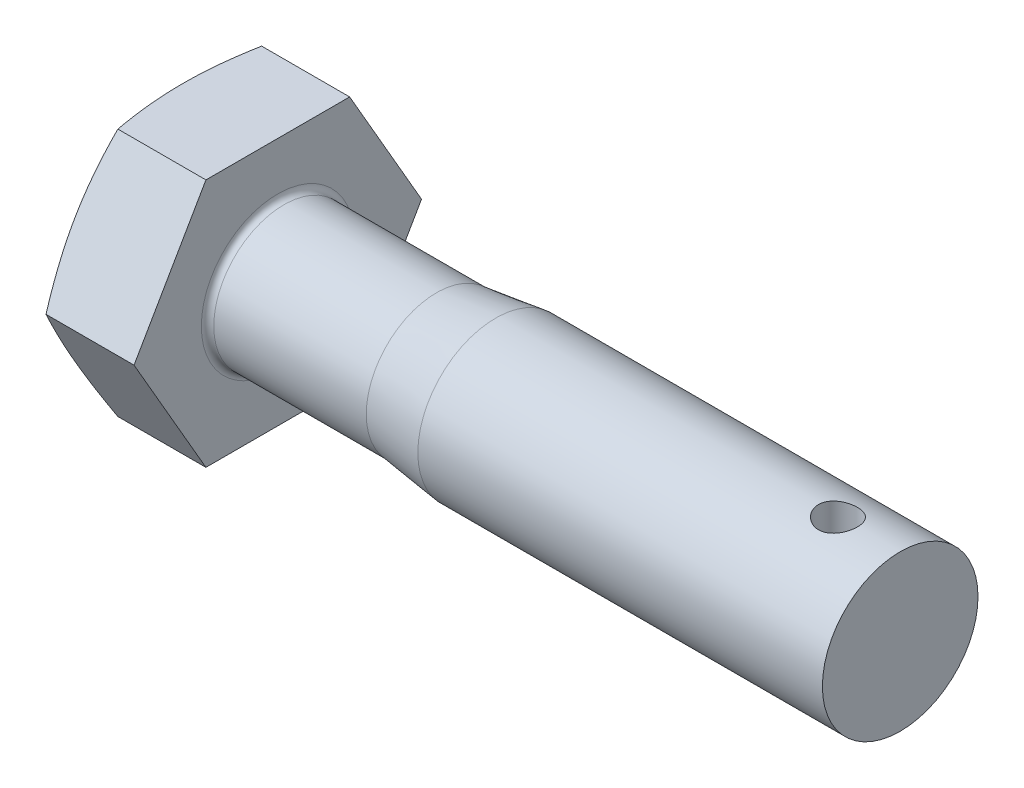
ISO-10303-21;
HEADER;
FILE_DESCRIPTION(('STEP AP214'),'2;1');
FILE_NAME('part.step','',(''),(''),'','','');
FILE_SCHEMA(('AUTOMOTIVE_DESIGN { 1 0 10303 214 1 1 1 1 }'));
ENDSEC;
DATA;
#1=APPLICATION_CONTEXT('core data for automotive mechanical design processes');
#2=APPLICATION_PROTOCOL_DEFINITION('international standard','automotive_design',2000,#1);
#3=PRODUCT_CONTEXT('',#1,'mechanical');
#4=PRODUCT('Part','Part','',(#3));
#5=PRODUCT_RELATED_PRODUCT_CATEGORY('part','',(#4));
#6=PRODUCT_DEFINITION_FORMATION('','',#4);
#7=PRODUCT_DEFINITION_CONTEXT('part definition',#1,'design');
#8=PRODUCT_DEFINITION('design','',#6,#7);
#9=PRODUCT_DEFINITION_SHAPE('','',#8);
#10=(LENGTH_UNIT() NAMED_UNIT(*) SI_UNIT(.MILLI.,.METRE.));
#11=(NAMED_UNIT(*) PLANE_ANGLE_UNIT() SI_UNIT($,.RADIAN.));
#12=(NAMED_UNIT(*) SI_UNIT($,.STERADIAN.) SOLID_ANGLE_UNIT());
#13=UNCERTAINTY_MEASURE_WITH_UNIT(LENGTH_MEASURE(1.E-05),#10,'distance_accuracy_value','');
#14=(GEOMETRIC_REPRESENTATION_CONTEXT(3) GLOBAL_UNCERTAINTY_ASSIGNED_CONTEXT((#13)) GLOBAL_UNIT_ASSIGNED_CONTEXT((#10,
#11,#12)) REPRESENTATION_CONTEXT('',''));
#15=CARTESIAN_POINT('',(0.,0.,0.));
#16=DIRECTION('',(0.,0.,1.));
#17=DIRECTION('',(1.,0.,0.));
#18=AXIS2_PLACEMENT_3D('',#15,#16,#17);
#19=CARTESIAN_POINT('',(0.,-8.,4.618802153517));
#20=DIRECTION('',(-1.,0.,0.));
#21=DIRECTION('',(0.,0.,1.));
#22=AXIS2_PLACEMENT_3D('',#19,#20,#21);
#23=PLANE('',#22);
#24=CARTESIAN_POINT('',(0.,0.,0.));
#25=DIRECTION('',(-1.,0.,0.));
#26=DIRECTION('',(0.,0.,1.));
#27=AXIS2_PLACEMENT_3D('',#24,#25,#26);
#28=CIRCLE('',#27,7.2);
#29=CARTESIAN_POINT('',(0.,0.,7.2));
#30=VERTEX_POINT('',#29);
#31=EDGE_CURVE('E97',#30,#30,#28,.T.);
#32=ORIENTED_EDGE('',*,*,#31,.T.);
#33=EDGE_LOOP('',(#32));
#34=FACE_BOUND('',#33,.T.);
#35=CARTESIAN_POINT('',(0.,0.,0.));
#36=DIRECTION('',(1.,0.,0.));
#37=DIRECTION('',(0.,0.,-1.));
#38=AXIS2_PLACEMENT_3D('',#35,#36,#37);
#39=CIRCLE('',#38,5.6);
#40=CARTESIAN_POINT('',(0.,0.,-5.6));
#41=VERTEX_POINT('',#40);
#42=EDGE_CURVE('E230',#41,#41,#39,.T.);
#43=ORIENTED_EDGE('',*,*,#42,.T.);
#44=EDGE_LOOP('',(#43));
#45=FACE_BOUND('',#44,.T.);
#46=ADVANCED_FACE('F32',(#34,#45),#23,.T.);
#47=CARTESIAN_POINT('',(6.4,-8.,4.618802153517));
#48=DIRECTION('',(0.,1.,0.));
#49=DIRECTION('',(0.,0.,1.));
#50=AXIS2_PLACEMENT_3D('',#47,#48,#49);
#51=PLANE('',#50);
#52=CARTESIAN_POINT('',(2.68976892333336,-8.,-12.2012465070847));
#53=CARTESIAN_POINT('',(2.57971664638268,-8.,-11.8395797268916));
#54=CARTESIAN_POINT('',(2.47095469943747,-8.,-11.4775129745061));
#55=CARTESIAN_POINT('',(2.25672537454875,-8.,-10.7523759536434));
#56=CARTESIAN_POINT('',(2.15125825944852,-8.,-10.3893056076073));
#57=CARTESIAN_POINT('',(1.94415537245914,-8.,-9.66133032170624));
#58=CARTESIAN_POINT('',(1.84252719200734,-8.,-9.29642321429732));
#59=CARTESIAN_POINT('',(1.64429920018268,-8.,-8.56524765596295));
#60=CARTESIAN_POINT('',(1.54769929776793,-8.,-8.19897922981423));
#61=CARTESIAN_POINT('',(1.36193890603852,-8.,-7.46941725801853));
#62=CARTESIAN_POINT('',(1.27270063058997,-8.,-7.10614361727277));
#63=CARTESIAN_POINT('',(1.10186352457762,-8.,-6.37778553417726));
#64=CARTESIAN_POINT('',(1.02026482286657,-8.,-6.01270106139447));
#65=CARTESIAN_POINT('',(0.866618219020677,-8.,-5.2806446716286));
#66=CARTESIAN_POINT('',(0.794566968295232,-8.,-4.91367346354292));
#67=CARTESIAN_POINT('',(0.662216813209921,-8.,-4.17760203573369));
#68=CARTESIAN_POINT('',(0.60191751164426,-8.,-3.80850188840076));
#69=CARTESIAN_POINT('',(0.501500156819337,-8.,-3.10978401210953));
#70=CARTESIAN_POINT('',(0.459876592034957,-8.,-2.78038468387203));
#71=CARTESIAN_POINT('',(0.389510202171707,-8.,-2.12020164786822));
#72=CARTESIAN_POINT('',(0.360767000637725,-8.,-1.78941798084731));
#73=CARTESIAN_POINT('',(0.317545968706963,-8.,-1.12713777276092));
#74=CARTESIAN_POINT('',(0.303058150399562,-8.,-0.795641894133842));
#75=CARTESIAN_POINT('',(0.289080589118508,-8.,-0.132330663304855));
#76=CARTESIAN_POINT('',(0.289590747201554,-8.,0.199484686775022));
#77=CARTESIAN_POINT('',(0.305622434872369,-8.,0.864453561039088));
#78=CARTESIAN_POINT('',(0.3212211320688,-8.,1.19760519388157));
#79=CARTESIAN_POINT('',(0.366713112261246,-8.,1.86292258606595));
#80=CARTESIAN_POINT('',(0.396606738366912,-8.,2.19508832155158));
#81=CARTESIAN_POINT('',(0.469296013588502,-8.,2.8582730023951));
#82=CARTESIAN_POINT('',(0.512102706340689,-8.,3.18929071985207));
#83=CARTESIAN_POINT('',(0.608889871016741,-8.,3.84966990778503));
#84=CARTESIAN_POINT('',(0.662870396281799,-8.,4.17903137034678));
#85=CARTESIAN_POINT('',(0.783783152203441,-8.,4.85578954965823));
#86=CARTESIAN_POINT('',(0.851298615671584,-8.,5.20308114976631));
#87=CARTESIAN_POINT('',(0.99502008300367,-8.,5.8958729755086));
#88=CARTESIAN_POINT('',(1.07122675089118,-8.,6.24137306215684));
#89=CARTESIAN_POINT('',(1.23072133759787,-8.,6.93083211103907));
#90=CARTESIAN_POINT('',(1.31401133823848,-8.,7.27479058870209));
#91=CARTESIAN_POINT('',(1.48631199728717,-8.,7.96125577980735));
#92=CARTESIAN_POINT('',(1.57532251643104,-8.,8.30376252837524));
#93=CARTESIAN_POINT('',(1.75810796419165,-8.,8.98797246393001));
#94=CARTESIAN_POINT('',(1.85188890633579,-8.,9.32967403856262));
#95=CARTESIAN_POINT('',(2.04325051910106,-8.,10.0120101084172));
#96=CARTESIAN_POINT('',(2.14083120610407,-8.,10.3526445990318));
#97=CARTESIAN_POINT('',(2.33909251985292,-8.,11.0329439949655));
#98=CARTESIAN_POINT('',(2.43977260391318,-8.,11.3726090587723));
#99=CARTESIAN_POINT('',(2.64371294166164,-8.,12.0511645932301));
#100=CARTESIAN_POINT('',(2.7469732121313,-8.,12.3900550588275));
#101=CARTESIAN_POINT('',(3.05757662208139,-8.,13.3980187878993));
#102=CARTESIAN_POINT('',(3.2680247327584,-8.,14.0661350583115));
#103=CARTESIAN_POINT('',(3.69484331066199,-8.,15.4004993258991));
#104=CARTESIAN_POINT('',(3.91121406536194,-8.,16.0667472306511));
#105=CARTESIAN_POINT('',(4.34746385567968,-8.,17.3952834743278));
#106=CARTESIAN_POINT('',(4.56732640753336,-8.,18.0575772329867));
#107=CARTESIAN_POINT('',(4.89953990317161,-8.,19.0501761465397));
#108=CARTESIAN_POINT('',(5.01067647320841,-8.,19.3808888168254));
#109=CARTESIAN_POINT('',(5.23366301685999,-8.,20.0420727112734));
#110=CARTESIAN_POINT('',(5.34551298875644,-8.,20.372543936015));
#111=CARTESIAN_POINT('',(5.45767192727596,-8.,20.7029103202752));
#112=B_SPLINE_CURVE_WITH_KNOTS('',3,(#52,#53,#54,#55,#56,#57,#58,#59,#60,#61,#62,#63,#64,#65,
#66,#67,#68,#69,#70,#71,#72,#73,#74,#75,#76,#77,#78,#79,#80,#81,#82,#83,#84,#85,#86,#87,#88,#89,
#90,#91,#92,#93,#94,#95,#96,#97,#98,#99,#100,#101,#102,#103,#104,#105,#106,#107,#108,#109,#110,
#111),.UNSPECIFIED.,.F.,.F.,(4,2,2,2,2,2,2,2,2,2,2,2,2,2,2,2,2,2,2,2,2,2,2,2,2,2,2,2,2,4),(0.,
1.13412858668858,2.26834741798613,3.40470280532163,4.54103761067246,5.66319372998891,
6.78536877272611,7.90714918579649,9.02889167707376,10.0247284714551,11.0205361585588,
12.015645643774,13.0107485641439,14.0109678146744,15.011211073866,16.0123122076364,
17.0134181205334,18.0746616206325,19.1359862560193,20.1976239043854,21.2592357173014,
22.3222206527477,23.3852101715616,24.4480146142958,25.5108259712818,27.6122114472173,
29.7136991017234,31.8071897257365,32.8538504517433,33.9005086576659),.UNSPECIFIED.);
#113=CARTESIAN_POINT('',(0.741627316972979,-8.00000000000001,-4.618802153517));
#114=VERTEX_POINT('',#113);
#115=CARTESIAN_POINT('',(0.741627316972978,-8.,4.618802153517));
#116=VERTEX_POINT('',#115);
#117=EDGE_CURVE('E54',#114,#116,#112,.T.);
#118=ORIENTED_EDGE('',*,*,#117,.F.);
#119=DIRECTION('',(-1.,0.,0.));
#120=VECTOR('',#119,1.);
#121=CARTESIAN_POINT('',(6.4,-8.,-4.61880215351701));
#122=LINE('',#121,#120);
#123=CARTESIAN_POINT('',(6.4,-8.,-4.61880215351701));
#124=VERTEX_POINT('',#123);
#125=EDGE_CURVE('E122',#124,#114,#122,.T.);
#126=ORIENTED_EDGE('',*,*,#125,.F.);
#127=DIRECTION('',(0.,0.,-1.));
#128=VECTOR('',#127,1.);
#129=CARTESIAN_POINT('',(6.4,-8.,4.618802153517));
#130=LINE('',#129,#128);
#131=CARTESIAN_POINT('',(6.4,-8.,4.618802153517));
#132=VERTEX_POINT('',#131);
#133=EDGE_CURVE('E259',#132,#124,#130,.T.);
#134=ORIENTED_EDGE('',*,*,#133,.F.);
#135=DIRECTION('',(-1.,0.,0.));
#136=VECTOR('',#135,1.);
#137=CARTESIAN_POINT('',(6.4,-8.,4.618802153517));
#138=LINE('',#137,#136);
#139=EDGE_CURVE('E110',#132,#116,#138,.T.);
#140=ORIENTED_EDGE('',*,*,#139,.T.);
#141=EDGE_LOOP('',(#118,#126,#134,#140));
#142=FACE_BOUND('',#141,.T.);
#143=ADVANCED_FACE('F34',(#142),#51,.F.);
#144=CARTESIAN_POINT('',(6.4,-8.,-4.61880215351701));
#145=DIRECTION('',(0.,0.5,0.866025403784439));
#146=DIRECTION('',(0.,-0.866025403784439,0.5));
#147=AXIS2_PLACEMENT_3D('',#144,#145,#146);
#148=PLANE('',#147);
#149=CARTESIAN_POINT('',(0.741669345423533,0.000200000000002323,-9.23771977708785));
#150=CARTESIAN_POINT('',(0.67202206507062,-0.331114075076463,-9.04643550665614));
#151=CARTESIAN_POINT('',(0.608665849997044,-0.663520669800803,-8.85452046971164));
#152=CARTESIAN_POINT('',(0.497200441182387,-1.33049516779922,-8.46944256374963));
#153=CARTESIAN_POINT('',(0.449103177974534,-1.66506455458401,-8.27627883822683));
#154=CARTESIAN_POINT('',(0.371307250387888,-2.33265174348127,-7.89084719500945));
#155=CARTESIAN_POINT('',(0.341438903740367,-2.66565429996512,-7.69858807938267));
#156=CARTESIAN_POINT('',(0.301377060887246,-3.33243813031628,-7.31362025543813));
#157=CARTESIAN_POINT('',(0.291176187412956,-3.66621906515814,-7.12091174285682));
#158=CARTESIAN_POINT('',(0.291176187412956,-4.33378093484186,-6.7354947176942));
#159=CARTESIAN_POINT('',(0.301377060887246,-4.66756186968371,-6.54278620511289));
#160=CARTESIAN_POINT('',(0.341438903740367,-5.33434570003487,-6.15781838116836));
#161=CARTESIAN_POINT('',(0.371307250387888,-5.66734825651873,-5.96555926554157));
#162=CARTESIAN_POINT('',(0.449103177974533,-6.33493544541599,-5.58012762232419));
#163=CARTESIAN_POINT('',(0.497200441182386,-6.66950483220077,-5.38696389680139));
#164=CARTESIAN_POINT('',(0.608665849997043,-7.33647933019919,-5.00188599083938));
#165=CARTESIAN_POINT('',(0.672022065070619,-7.66888592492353,-4.80997095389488));
#166=CARTESIAN_POINT('',(0.741669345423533,-8.0002,-4.61868668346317));
#167=B_SPLINE_CURVE_WITH_KNOTS('',3,(#149,#150,#151,#152,#153,#154,#155,#156,#157,#158,#159,
#160,#161,#162,#163,#164,#165,#166),.UNSPECIFIED.,.F.,.F.,(4,2,2,2,2,2,2,2,4),(0.,
1.16669003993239,2.33429004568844,3.4908488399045,4.6469737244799,5.80309860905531,
6.95965740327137,8.12725740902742,9.29394744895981),.UNSPECIFIED.);
#168=CARTESIAN_POINT('',(0.741627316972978,0.,-9.23760430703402));
#169=VERTEX_POINT('',#168);
#170=EDGE_CURVE('E192',#169,#114,#167,.T.);
#171=ORIENTED_EDGE('',*,*,#170,.F.);
#172=DIRECTION('',(-1.,0.,0.));
#173=VECTOR('',#172,1.);
#174=CARTESIAN_POINT('',(6.4,0.,-9.23760430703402));
#175=LINE('',#174,#173);
#176=CARTESIAN_POINT('',(6.4,0.,-9.23760430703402));
#177=VERTEX_POINT('',#176);
#178=EDGE_CURVE('E119',#177,#169,#175,.T.);
#179=ORIENTED_EDGE('',*,*,#178,.F.);
#180=DIRECTION('',(0.,0.866025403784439,-0.5));
#181=VECTOR('',#180,1.);
#182=CARTESIAN_POINT('',(6.4,-8.,-4.61880215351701));
#183=LINE('',#182,#181);
#184=EDGE_CURVE('E260',#124,#177,#183,.T.);
#185=ORIENTED_EDGE('',*,*,#184,.F.);
#186=ORIENTED_EDGE('',*,*,#125,.T.);
#187=EDGE_LOOP('',(#171,#179,#185,#186));
#188=FACE_BOUND('',#187,.T.);
#189=ADVANCED_FACE('F200',(#188),#148,.F.);
#190=CARTESIAN_POINT('',(6.4,0.,-9.23760430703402));
#191=DIRECTION('',(0.,-0.5,0.866025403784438));
#192=DIRECTION('',(0.,-0.866025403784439,-0.5));
#193=AXIS2_PLACEMENT_3D('',#190,#191,#192);
#194=PLANE('',#193);
#195=CARTESIAN_POINT('',(0.741669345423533,8.0002,-4.61868668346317));
#196=CARTESIAN_POINT('',(0.672022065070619,7.66888592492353,-4.80997095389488));
#197=CARTESIAN_POINT('',(0.608665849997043,7.33647933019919,-5.00188599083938));
#198=CARTESIAN_POINT('',(0.497200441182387,6.66950483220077,-5.38696389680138));
#199=CARTESIAN_POINT('',(0.449103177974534,6.33493544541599,-5.58012762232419));
#200=CARTESIAN_POINT('',(0.371307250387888,5.66734825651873,-5.96555926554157));
#201=CARTESIAN_POINT('',(0.341438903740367,5.33434570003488,-6.15781838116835));
#202=CARTESIAN_POINT('',(0.301377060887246,4.66756186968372,-6.54278620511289));
#203=CARTESIAN_POINT('',(0.291176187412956,4.33378093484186,-6.7354947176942));
#204=CARTESIAN_POINT('',(0.291176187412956,3.66621906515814,-7.12091174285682));
#205=CARTESIAN_POINT('',(0.301377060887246,3.33243813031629,-7.31362025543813));
#206=CARTESIAN_POINT('',(0.341438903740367,2.66565429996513,-7.69858807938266));
#207=CARTESIAN_POINT('',(0.371307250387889,2.33265174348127,-7.89084719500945));
#208=CARTESIAN_POINT('',(0.449103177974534,1.66506455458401,-8.27627883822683));
#209=CARTESIAN_POINT('',(0.497200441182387,1.33049516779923,-8.46944256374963));
#210=CARTESIAN_POINT('',(0.608665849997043,0.66352066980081,-8.85452046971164));
#211=CARTESIAN_POINT('',(0.672022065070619,0.331114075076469,-9.04643550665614));
#212=CARTESIAN_POINT('',(0.741669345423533,-0.000199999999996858,-9.23771977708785));
#213=B_SPLINE_CURVE_WITH_KNOTS('',3,(#195,#196,#197,#198,#199,#200,#201,#202,#203,#204,#205,
#206,#207,#208,#209,#210,#211,#212),.UNSPECIFIED.,.F.,.F.,(4,2,2,2,2,2,2,2,4),(0.,
1.16669003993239,2.33429004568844,3.4908488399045,4.6469737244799,5.80309860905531,
6.95965740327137,8.12725740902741,9.2939474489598),.UNSPECIFIED.);
#214=CARTESIAN_POINT('',(0.741627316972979,8.,-4.61880215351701));
#215=VERTEX_POINT('',#214);
#216=EDGE_CURVE('E186',#215,#169,#213,.T.);
#217=ORIENTED_EDGE('',*,*,#216,.F.);
#218=DIRECTION('',(-1.,0.,0.));
#219=VECTOR('',#218,1.);
#220=CARTESIAN_POINT('',(6.4,8.,-4.618802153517));
#221=LINE('',#220,#219);
#222=CARTESIAN_POINT('',(6.4,8.,-4.618802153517));
#223=VERTEX_POINT('',#222);
#224=EDGE_CURVE('E112',#223,#215,#221,.T.);
#225=ORIENTED_EDGE('',*,*,#224,.F.);
#226=DIRECTION('',(0.,0.866025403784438,0.5));
#227=VECTOR('',#226,1.);
#228=CARTESIAN_POINT('',(6.4,0.,-9.23760430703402));
#229=LINE('',#228,#227);
#230=EDGE_CURVE('E264',#177,#223,#229,.T.);
#231=ORIENTED_EDGE('',*,*,#230,.F.);
#232=ORIENTED_EDGE('',*,*,#178,.T.);
#233=EDGE_LOOP('',(#217,#225,#231,#232));
#234=FACE_BOUND('',#233,.T.);
#235=ADVANCED_FACE('F203',(#234),#194,.F.);
#236=CARTESIAN_POINT('',(6.4,8.,-4.618802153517));
#237=DIRECTION('',(0.,-1.,0.));
#238=DIRECTION('',(0.,0.,-1.));
#239=AXIS2_PLACEMENT_3D('',#236,#237,#238);
#240=PLANE('',#239);
#241=CARTESIAN_POINT('',(2.68976892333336,8.,-12.2012465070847));
#242=CARTESIAN_POINT('',(2.57971664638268,8.,-11.8395797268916));
#243=CARTESIAN_POINT('',(2.47095469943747,8.,-11.4775129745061));
#244=CARTESIAN_POINT('',(2.25672537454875,8.,-10.7523759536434));
#245=CARTESIAN_POINT('',(2.15125825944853,8.,-10.3893056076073));
#246=CARTESIAN_POINT('',(1.94415537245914,8.,-9.66133032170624));
#247=CARTESIAN_POINT('',(1.84252719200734,8.,-9.29642321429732));
#248=CARTESIAN_POINT('',(1.64429920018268,8.,-8.56524765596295));
#249=CARTESIAN_POINT('',(1.54769929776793,8.,-8.19897922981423));
#250=CARTESIAN_POINT('',(1.36193890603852,8.,-7.46941725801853));
#251=CARTESIAN_POINT('',(1.27270063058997,8.,-7.10614361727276));
#252=CARTESIAN_POINT('',(1.10186352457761,8.,-6.37778553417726));
#253=CARTESIAN_POINT('',(1.02026482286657,8.,-6.01270106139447));
#254=CARTESIAN_POINT('',(0.866618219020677,8.,-5.2806446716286));
#255=CARTESIAN_POINT('',(0.794566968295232,8.,-4.91367346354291));
#256=CARTESIAN_POINT('',(0.662216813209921,8.,-4.17760203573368));
#257=CARTESIAN_POINT('',(0.60191751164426,8.,-3.80850188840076));
#258=CARTESIAN_POINT('',(0.501500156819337,8.,-3.10978401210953));
#259=CARTESIAN_POINT('',(0.459876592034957,8.,-2.78038468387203));
#260=CARTESIAN_POINT('',(0.389510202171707,8.,-2.12020164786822));
#261=CARTESIAN_POINT('',(0.360767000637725,8.,-1.7894179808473));
#262=CARTESIAN_POINT('',(0.317545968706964,8.,-1.12713777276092));
#263=CARTESIAN_POINT('',(0.303058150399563,8.,-0.795641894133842));
#264=CARTESIAN_POINT('',(0.289080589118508,8.,-0.132330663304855));
#265=CARTESIAN_POINT('',(0.289590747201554,8.,0.199484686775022));
#266=CARTESIAN_POINT('',(0.305622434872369,8.,0.864453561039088));
#267=CARTESIAN_POINT('',(0.3212211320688,8.,1.19760519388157));
#268=CARTESIAN_POINT('',(0.366713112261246,8.,1.86292258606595));
#269=CARTESIAN_POINT('',(0.396606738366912,8.,2.19508832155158));
#270=CARTESIAN_POINT('',(0.469296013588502,8.,2.8582730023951));
#271=CARTESIAN_POINT('',(0.512102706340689,8.,3.18929071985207));
#272=CARTESIAN_POINT('',(0.608889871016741,8.,3.84966990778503));
#273=CARTESIAN_POINT('',(0.662870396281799,8.,4.17903137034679));
#274=CARTESIAN_POINT('',(0.783783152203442,8.,4.85578954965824));
#275=CARTESIAN_POINT('',(0.851298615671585,8.,5.20308114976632));
#276=CARTESIAN_POINT('',(0.995020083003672,8.,5.8958729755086));
#277=CARTESIAN_POINT('',(1.07122675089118,8.,6.24137306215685));
#278=CARTESIAN_POINT('',(1.23072133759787,8.,6.93083211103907));
#279=CARTESIAN_POINT('',(1.31401133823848,8.,7.2747905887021));
#280=CARTESIAN_POINT('',(1.48631199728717,8.,7.96125577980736));
#281=CARTESIAN_POINT('',(1.57532251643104,8.,8.30376252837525));
#282=CARTESIAN_POINT('',(1.75810796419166,8.,8.98797246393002));
#283=CARTESIAN_POINT('',(1.8518889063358,8.,9.32967403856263));
#284=CARTESIAN_POINT('',(2.04325051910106,8.,10.0120101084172));
#285=CARTESIAN_POINT('',(2.14083120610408,8.,10.3526445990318));
#286=CARTESIAN_POINT('',(2.33909251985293,8.,11.0329439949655));
#287=CARTESIAN_POINT('',(2.43977260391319,8.,11.3726090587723));
#288=CARTESIAN_POINT('',(2.64371294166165,8.,12.0511645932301));
#289=CARTESIAN_POINT('',(2.74697321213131,8.,12.3900550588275));
#290=CARTESIAN_POINT('',(3.0575766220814,8.,13.3980187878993));
#291=CARTESIAN_POINT('',(3.26802473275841,8.,14.0661350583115));
#292=CARTESIAN_POINT('',(3.694843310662,8.,15.4004993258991));
#293=CARTESIAN_POINT('',(3.91121406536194,8.,16.0667472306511));
#294=CARTESIAN_POINT('',(4.34746385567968,8.,17.3952834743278));
#295=CARTESIAN_POINT('',(4.56732640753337,8.,18.0575772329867));
#296=CARTESIAN_POINT('',(4.89953990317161,8.,19.0501761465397));
#297=CARTESIAN_POINT('',(5.01067647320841,8.,19.3808888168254));
#298=CARTESIAN_POINT('',(5.23366301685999,8.,20.0420727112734));
#299=CARTESIAN_POINT('',(5.34551298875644,8.,20.372543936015));
#300=CARTESIAN_POINT('',(5.45767192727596,8.,20.7029103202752));
#301=B_SPLINE_CURVE_WITH_KNOTS('',3,(#241,#242,#243,#244,#245,#246,#247,#248,#249,#250,#251,
#252,#253,#254,#255,#256,#257,#258,#259,#260,#261,#262,#263,#264,#265,#266,#267,#268,#269,#270,
#271,#272,#273,#274,#275,#276,#277,#278,#279,#280,#281,#282,#283,#284,#285,#286,#287,#288,#289,
#290,#291,#292,#293,#294,#295,#296,#297,#298,#299,#300),.UNSPECIFIED.,.F.,.F.,(4,2,2,2,2,2,2,2,
2,2,2,2,2,2,2,2,2,2,2,2,2,2,2,2,2,2,2,2,2,4),(0.,1.13412858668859,2.26834741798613,
3.40470280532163,4.54103761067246,5.66319372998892,6.78536877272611,7.9071491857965,
9.02889167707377,10.0247284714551,11.0205361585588,12.015645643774,13.0107485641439,
14.0109678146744,15.011211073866,16.0123122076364,17.0134181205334,18.0746616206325,
19.1359862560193,20.1976239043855,21.2592357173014,22.3222206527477,23.3852101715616,
24.4480146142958,25.5108259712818,27.6122114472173,29.7136991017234,31.8071897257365,
32.8538504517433,33.9005086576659),.UNSPECIFIED.);
#302=CARTESIAN_POINT('',(0.74162731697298,8.,4.61880215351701));
#303=VERTEX_POINT('',#302);
#304=EDGE_CURVE('E107',#303,#215,#301,.F.);
#305=ORIENTED_EDGE('',*,*,#304,.F.);
#306=DIRECTION('',(-1.,0.,0.));
#307=VECTOR('',#306,1.);
#308=CARTESIAN_POINT('',(6.4,8.,4.61880215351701));
#309=LINE('',#308,#307);
#310=CARTESIAN_POINT('',(6.4,8.,4.61880215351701));
#311=VERTEX_POINT('',#310);
#312=EDGE_CURVE('E106',#311,#303,#309,.T.);
#313=ORIENTED_EDGE('',*,*,#312,.F.);
#314=DIRECTION('',(0.,0.,1.));
#315=VECTOR('',#314,1.);
#316=CARTESIAN_POINT('',(6.4,8.,-4.618802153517));
#317=LINE('',#316,#315);
#318=EDGE_CURVE('E266',#223,#311,#317,.T.);
#319=ORIENTED_EDGE('',*,*,#318,.F.);
#320=ORIENTED_EDGE('',*,*,#224,.T.);
#321=EDGE_LOOP('',(#305,#313,#319,#320));
#322=FACE_BOUND('',#321,.T.);
#323=ADVANCED_FACE('F207',(#322),#240,.F.);
#324=CARTESIAN_POINT('',(6.4,8.,4.61880215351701));
#325=DIRECTION('',(0.,-0.5,-0.866025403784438));
#326=DIRECTION('',(0.,0.866025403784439,-0.5));
#327=AXIS2_PLACEMENT_3D('',#324,#325,#326);
#328=PLANE('',#327);
#329=CARTESIAN_POINT('',(0.741669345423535,-0.000199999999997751,9.23771977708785));
#330=CARTESIAN_POINT('',(0.672022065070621,0.331114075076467,9.04643550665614));
#331=CARTESIAN_POINT('',(0.608665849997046,0.663520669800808,8.85452046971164));
#332=CARTESIAN_POINT('',(0.497200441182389,1.33049516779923,8.46944256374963));
#333=CARTESIAN_POINT('',(0.449103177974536,1.66506455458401,8.27627883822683));
#334=CARTESIAN_POINT('',(0.371307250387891,2.33265174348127,7.89084719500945));
#335=CARTESIAN_POINT('',(0.341438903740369,2.66565429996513,7.69858807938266));
#336=CARTESIAN_POINT('',(0.301377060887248,3.33243813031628,7.31362025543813));
#337=CARTESIAN_POINT('',(0.291176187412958,3.66621906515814,7.12091174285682));
#338=CARTESIAN_POINT('',(0.291176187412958,4.33378093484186,6.7354947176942));
#339=CARTESIAN_POINT('',(0.301377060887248,4.66756186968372,6.54278620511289));
#340=CARTESIAN_POINT('',(0.341438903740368,5.33434570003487,6.15781838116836));
#341=CARTESIAN_POINT('',(0.37130725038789,5.66734825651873,5.96555926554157));
#342=CARTESIAN_POINT('',(0.449103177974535,6.33493544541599,5.58012762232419));
#343=CARTESIAN_POINT('',(0.497200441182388,6.66950483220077,5.38696389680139));
#344=CARTESIAN_POINT('',(0.608665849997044,7.33647933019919,5.00188599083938));
#345=CARTESIAN_POINT('',(0.67202206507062,7.66888592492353,4.80997095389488));
#346=CARTESIAN_POINT('',(0.741669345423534,8.0002,4.61868668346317));
#347=B_SPLINE_CURVE_WITH_KNOTS('',3,(#329,#330,#331,#332,#333,#334,#335,#336,#337,#338,#339,
#340,#341,#342,#343,#344,#345,#346),.UNSPECIFIED.,.F.,.F.,(4,2,2,2,2,2,2,2,4),(0.,
1.16669003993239,2.33429004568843,3.49084883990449,4.6469737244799,5.8030986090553,
6.95965740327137,8.12725740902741,9.2939474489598),.UNSPECIFIED.);
#348=CARTESIAN_POINT('',(0.74162731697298,0.,9.23760430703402));
#349=VERTEX_POINT('',#348);
#350=EDGE_CURVE('E92',#349,#303,#347,.T.);
#351=ORIENTED_EDGE('',*,*,#350,.F.);
#352=DIRECTION('',(-1.,0.,0.));
#353=VECTOR('',#352,1.);
#354=CARTESIAN_POINT('',(6.4,0.,9.23760430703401));
#355=LINE('',#354,#353);
#356=CARTESIAN_POINT('',(6.4,0.,9.23760430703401));
#357=VERTEX_POINT('',#356);
#358=EDGE_CURVE('E104',#357,#349,#355,.T.);
#359=ORIENTED_EDGE('',*,*,#358,.F.);
#360=DIRECTION('',(0.,-0.866025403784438,0.5));
#361=VECTOR('',#360,1.);
#362=CARTESIAN_POINT('',(6.4,8.,4.61880215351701));
#363=LINE('',#362,#361);
#364=EDGE_CURVE('E268',#311,#357,#363,.T.);
#365=ORIENTED_EDGE('',*,*,#364,.F.);
#366=ORIENTED_EDGE('',*,*,#312,.T.);
#367=EDGE_LOOP('',(#351,#359,#365,#366));
#368=FACE_BOUND('',#367,.T.);
#369=ADVANCED_FACE('F102',(#368),#328,.F.);
#370=CARTESIAN_POINT('',(6.4,0.,9.23760430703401));
#371=DIRECTION('',(0.,0.5,-0.866025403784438));
#372=DIRECTION('',(0.,0.866025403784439,0.5));
#373=AXIS2_PLACEMENT_3D('',#370,#371,#372);
#374=PLANE('',#373);
#375=CARTESIAN_POINT('',(0.741669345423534,-8.0002,4.61868668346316));
#376=CARTESIAN_POINT('',(0.672022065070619,-7.66888592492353,4.80997095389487));
#377=CARTESIAN_POINT('',(0.608665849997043,-7.33647933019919,5.00188599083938));
#378=CARTESIAN_POINT('',(0.497200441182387,-6.66950483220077,5.38696389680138));
#379=CARTESIAN_POINT('',(0.449103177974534,-6.33493544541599,5.58012762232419));
#380=CARTESIAN_POINT('',(0.371307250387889,-5.66734825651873,5.96555926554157));
#381=CARTESIAN_POINT('',(0.341438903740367,-5.33434570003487,6.15781838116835));
#382=CARTESIAN_POINT('',(0.301377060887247,-4.66756186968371,6.54278620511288));
#383=CARTESIAN_POINT('',(0.291176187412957,-4.33378093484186,6.7354947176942));
#384=CARTESIAN_POINT('',(0.291176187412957,-3.66621906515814,7.12091174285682));
#385=CARTESIAN_POINT('',(0.301377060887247,-3.33243813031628,7.31362025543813));
#386=CARTESIAN_POINT('',(0.341438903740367,-2.66565429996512,7.69858807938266));
#387=CARTESIAN_POINT('',(0.371307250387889,-2.33265174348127,7.89084719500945));
#388=CARTESIAN_POINT('',(0.449103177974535,-1.66506455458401,8.27627883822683));
#389=CARTESIAN_POINT('',(0.497200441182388,-1.33049516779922,8.46944256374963));
#390=CARTESIAN_POINT('',(0.608665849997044,-0.663520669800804,8.85452046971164));
#391=CARTESIAN_POINT('',(0.672022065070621,-0.331114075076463,9.04643550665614));
#392=CARTESIAN_POINT('',(0.741669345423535,0.00020000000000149,9.23771977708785));
#393=B_SPLINE_CURVE_WITH_KNOTS('',3,(#375,#376,#377,#378,#379,#380,#381,#382,#383,#384,#385,
#386,#387,#388,#389,#390,#391,#392),.UNSPECIFIED.,.F.,.F.,(4,2,2,2,2,2,2,2,4),(0.,
1.16669003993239,2.33429004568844,3.4908488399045,4.6469737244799,5.80309860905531,
6.95965740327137,8.12725740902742,9.29394744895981),.UNSPECIFIED.);
#394=EDGE_CURVE('E89',#116,#349,#393,.T.);
#395=ORIENTED_EDGE('',*,*,#394,.F.);
#396=ORIENTED_EDGE('',*,*,#139,.F.);
#397=DIRECTION('',(0.,-0.866025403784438,-0.5));
#398=VECTOR('',#397,1.);
#399=CARTESIAN_POINT('',(6.4,0.,9.23760430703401));
#400=LINE('',#399,#398);
#401=EDGE_CURVE('E62',#357,#132,#400,.T.);
#402=ORIENTED_EDGE('',*,*,#401,.F.);
#403=ORIENTED_EDGE('',*,*,#358,.T.);
#404=EDGE_LOOP('',(#395,#396,#402,#403));
#405=FACE_BOUND('',#404,.T.);
#406=ADVANCED_FACE('F109',(#405),#374,.F.);
#407=CARTESIAN_POINT('',(6.4,-8.,4.618802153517));
#408=DIRECTION('',(-1.,0.,0.));
#409=DIRECTION('',(0.,0.,1.));
#410=AXIS2_PLACEMENT_3D('',#407,#408,#409);
#411=PLANE('',#410);
#412=CARTESIAN_POINT('',(6.4,0.,0.));
#413=DIRECTION('',(-1.,0.,0.));
#414=DIRECTION('',(0.,0.,1.));
#415=AXIS2_PLACEMENT_3D('',#412,#413,#414);
#416=CIRCLE('',#415,4.913);
#417=CARTESIAN_POINT('',(6.4,0.,4.913));
#418=VERTEX_POINT('',#417);
#419=EDGE_CURVE('E46',#418,#418,#416,.T.);
#420=ORIENTED_EDGE('',*,*,#419,.T.);
#421=EDGE_LOOP('',(#420));
#422=FACE_BOUND('',#421,.T.);
#423=ORIENTED_EDGE('',*,*,#401,.T.);
#424=ORIENTED_EDGE('',*,*,#133,.T.);
#425=ORIENTED_EDGE('',*,*,#184,.T.);
#426=ORIENTED_EDGE('',*,*,#230,.T.);
#427=ORIENTED_EDGE('',*,*,#318,.T.);
#428=ORIENTED_EDGE('',*,*,#364,.T.);
#429=EDGE_LOOP('',(#423,#424,#425,#426,#427,#428));
#430=FACE_BOUND('',#429,.T.);
#431=ADVANCED_FACE('F163',(#422,#430),#411,.F.);
#432=CARTESIAN_POINT('',(0.,0.,0.));
#433=DIRECTION('',(1.,0.,0.));
#434=DIRECTION('',(0.,0.,-1.));
#435=AXIS2_PLACEMENT_3D('',#432,#433,#434);
#436=CONICAL_SURFACE('',#435,7.2,1.22173047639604);
#437=ORIENTED_EDGE('',*,*,#31,.F.);
#438=EDGE_LOOP('',(#437));
#439=FACE_BOUND('',#438,.T.);
#440=ORIENTED_EDGE('',*,*,#117,.T.);
#441=ORIENTED_EDGE('',*,*,#394,.T.);
#442=ORIENTED_EDGE('',*,*,#350,.T.);
#443=ORIENTED_EDGE('',*,*,#304,.T.);
#444=ORIENTED_EDGE('',*,*,#216,.T.);
#445=ORIENTED_EDGE('',*,*,#170,.T.);
#446=EDGE_LOOP('',(#440,#441,#442,#443,#444,#445));
#447=FACE_BOUND('',#446,.T.);
#448=ADVANCED_FACE('F91',(#439,#447),#436,.T.);
#449=CARTESIAN_POINT('',(1.28,0.,0.));
#450=DIRECTION('',(-1.,0.,0.));
#451=DIRECTION('',(0.,0.,1.));
#452=AXIS2_PLACEMENT_3D('',#449,#450,#451);
#453=CYLINDRICAL_SURFACE('',#452,5.6);
#454=CARTESIAN_POINT('',(1.28,0.,0.));
#455=DIRECTION('',(1.,0.,0.));
#456=DIRECTION('',(0.,0.,-1.));
#457=AXIS2_PLACEMENT_3D('',#454,#455,#456);
#458=CIRCLE('',#457,5.6);
#459=CARTESIAN_POINT('',(1.28,0.,-5.6));
#460=VERTEX_POINT('',#459);
#461=EDGE_CURVE('E232',#460,#460,#458,.T.);
#462=ORIENTED_EDGE('',*,*,#461,.T.);
#463=EDGE_LOOP('',(#462));
#464=FACE_BOUND('',#463,.T.);
#465=ORIENTED_EDGE('',*,*,#42,.F.);
#466=EDGE_LOOP('',(#465));
#467=FACE_BOUND('',#466,.T.);
#468=ADVANCED_FACE('F156',(#464,#467),#453,.F.);
#469=CARTESIAN_POINT('',(1.28,0.,0.));
#470=DIRECTION('',(1.,0.,0.));
#471=DIRECTION('',(0.,0.,-1.));
#472=AXIS2_PLACEMENT_3D('',#469,#470,#471);
#473=PLANE('',#472);
#474=ORIENTED_EDGE('',*,*,#461,.F.);
#475=EDGE_LOOP('',(#474));
#476=FACE_BOUND('',#475,.T.);
#477=ADVANCED_FACE('F152',(#476),#473,.F.);
#478=CARTESIAN_POINT('',(16.6,0.,0.));
#479=DIRECTION('',(1.,0.,0.));
#480=DIRECTION('',(0.,0.,-1.));
#481=AXIS2_PLACEMENT_3D('',#478,#479,#480);
#482=CONICAL_SURFACE('',#481,4.513,0.127463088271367);
#483=CARTESIAN_POINT('',(20.4,0.,0.));
#484=DIRECTION('',(-1.,0.,0.));
#485=DIRECTION('',(0.,0.,1.));
#486=AXIS2_PLACEMENT_3D('',#483,#484,#485);
#487=CIRCLE('',#486,5.);
#488=CARTESIAN_POINT('',(20.4,0.,4.99999999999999));
#489=VERTEX_POINT('',#488);
#490=EDGE_CURVE('E233',#489,#489,#487,.T.);
#491=ORIENTED_EDGE('',*,*,#490,.T.);
#492=EDGE_LOOP('',(#491));
#493=FACE_BOUND('',#492,.T.);
#494=CARTESIAN_POINT('',(16.6,0.,0.));
#495=DIRECTION('',(-1.,0.,0.));
#496=DIRECTION('',(0.,0.,1.));
#497=AXIS2_PLACEMENT_3D('',#494,#495,#496);
#498=CIRCLE('',#497,4.513);
#499=CARTESIAN_POINT('',(16.6,0.,4.513));
#500=VERTEX_POINT('',#499);
#501=EDGE_CURVE('E238',#500,#500,#498,.T.);
#502=ORIENTED_EDGE('',*,*,#501,.F.);
#503=EDGE_LOOP('',(#502));
#504=FACE_BOUND('',#503,.T.);
#505=ADVANCED_FACE('F148',(#493,#504),#482,.T.);
#506=CARTESIAN_POINT('',(0.,0.,0.));
#507=DIRECTION('',(-1.,0.,0.));
#508=DIRECTION('',(0.,0.,1.));
#509=AXIS2_PLACEMENT_3D('',#506,#507,#508);
#510=CYLINDRICAL_SURFACE('',#509,4.513);
#511=CARTESIAN_POINT('',(6.8,0.,0.));
#512=DIRECTION('',(-1.,0.,0.));
#513=DIRECTION('',(0.,0.,1.));
#514=AXIS2_PLACEMENT_3D('',#511,#512,#513);
#515=CIRCLE('',#514,4.513);
#516=CARTESIAN_POINT('',(6.8,0.,4.513));
#517=VERTEX_POINT('',#516);
#518=EDGE_CURVE('E11',#517,#517,#515,.F.);
#519=ORIENTED_EDGE('',*,*,#518,.T.);
#520=EDGE_LOOP('',(#519));
#521=FACE_BOUND('',#520,.T.);
#522=ORIENTED_EDGE('',*,*,#501,.T.);
#523=EDGE_LOOP('',(#522));
#524=FACE_BOUND('',#523,.T.);
#525=ADVANCED_FACE('F144',(#521,#524),#510,.T.);
#526=CARTESIAN_POINT('',(46.4,0.,0.));
#527=DIRECTION('',(1.,0.,0.));
#528=DIRECTION('',(0.,0.,-1.));
#529=AXIS2_PLACEMENT_3D('',#526,#527,#528);
#530=PLANE('',#529);
#531=CARTESIAN_POINT('',(46.4,0.,0.));
#532=DIRECTION('',(1.,0.,0.));
#533=DIRECTION('',(0.,0.,-1.));
#534=AXIS2_PLACEMENT_3D('',#531,#532,#533);
#535=CIRCLE('',#534,5.);
#536=CARTESIAN_POINT('',(46.4,0.,-5.));
#537=VERTEX_POINT('',#536);
#538=EDGE_CURVE('E255',#537,#537,#535,.T.);
#539=ORIENTED_EDGE('',*,*,#538,.T.);
#540=EDGE_LOOP('',(#539));
#541=FACE_BOUND('',#540,.T.);
#542=ADVANCED_FACE('F147',(#541),#530,.T.);
#543=CARTESIAN_POINT('',(46.4,0.,0.));
#544=DIRECTION('',(-1.,0.,0.));
#545=DIRECTION('',(0.,0.,1.));
#546=AXIS2_PLACEMENT_3D('',#543,#544,#545);
#547=CYLINDRICAL_SURFACE('',#546,5.);
#548=CARTESIAN_POINT('',(42.4,-4.84122918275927,1.25));
#549=CARTESIAN_POINT('',(42.4690253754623,-4.84123050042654,1.24999803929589));
#550=CARTESIAN_POINT('',(42.538072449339,-4.84272153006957,1.24426312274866));
#551=CARTESIAN_POINT('',(42.674183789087,-4.84850930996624,1.22151156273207));
#552=CARTESIAN_POINT('',(42.7412468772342,-4.85280769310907,1.2044883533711));
#553=CARTESIAN_POINT('',(42.8714017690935,-4.86369362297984,1.15974559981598));
#554=CARTESIAN_POINT('',(42.9344985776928,-4.87027821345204,1.13203986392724));
#555=CARTESIAN_POINT('',(43.05515542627,-4.88499096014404,1.06676057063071));
#556=CARTESIAN_POINT('',(43.1127152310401,-4.89311918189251,1.02918659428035));
#557=CARTESIAN_POINT('',(43.2219308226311,-4.91020358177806,0.944354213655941));
#558=CARTESIAN_POINT('',(43.273446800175,-4.91917298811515,0.896918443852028));
#559=CARTESIAN_POINT('',(43.3678806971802,-4.93681437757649,0.794091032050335));
#560=CARTESIAN_POINT('',(43.4107978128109,-4.94548633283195,0.738698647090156));
#561=CARTESIAN_POINT('',(43.4873877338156,-4.96170207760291,0.620572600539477));
#562=CARTESIAN_POINT('',(43.5209231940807,-4.96922843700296,0.557747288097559));
#563=CARTESIAN_POINT('',(43.5769048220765,-4.98215405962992,0.427131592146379));
#564=CARTESIAN_POINT('',(43.5993526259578,-4.98755363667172,0.359341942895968));
#565=CARTESIAN_POINT('',(43.6320739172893,-4.9955237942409,0.222179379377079));
#566=CARTESIAN_POINT('',(43.6425848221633,-4.99814946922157,0.152866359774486));
#567=CARTESIAN_POINT('',(43.6518791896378,-5.00046797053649,0.0134144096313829));
#568=CARTESIAN_POINT('',(43.6506643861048,-5.00016123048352,-0.0567243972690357));
#569=CARTESIAN_POINT('',(43.6367125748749,-4.99669047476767,-0.194190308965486));
#570=CARTESIAN_POINT('',(43.6242318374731,-4.99359001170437,-0.261545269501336));
#571=CARTESIAN_POINT('',(43.5885143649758,-4.98495418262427,-0.393172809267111));
#572=CARTESIAN_POINT('',(43.5652770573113,-4.9794186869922,-0.457445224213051));
#573=CARTESIAN_POINT('',(43.5084987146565,-4.96643754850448,-0.581758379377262));
#574=CARTESIAN_POINT('',(43.4748664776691,-4.95897509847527,-0.641755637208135));
#575=CARTESIAN_POINT('',(43.3983221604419,-4.94294951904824,-0.755344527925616));
#576=CARTESIAN_POINT('',(43.3554084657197,-4.93438619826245,-0.808935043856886));
#577=CARTESIAN_POINT('',(43.2601456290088,-4.9168185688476,-0.909717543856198));
#578=CARTESIAN_POINT('',(43.2075725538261,-4.90780859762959,-0.956697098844));
#579=CARTESIAN_POINT('',(43.0952000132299,-4.89057521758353,-1.04122046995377));
#580=CARTESIAN_POINT('',(43.0354002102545,-4.88235184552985,-1.07876384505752));
#581=CARTESIAN_POINT('',(42.9098549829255,-4.86760248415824,-1.14348516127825));
#582=CARTESIAN_POINT('',(42.8440821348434,-4.8610849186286,-1.17061195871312));
#583=CARTESIAN_POINT('',(42.7087072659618,-4.85059320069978,-1.21335702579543));
#584=CARTESIAN_POINT('',(42.6391060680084,-4.84661850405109,-1.22897775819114));
#585=CARTESIAN_POINT('',(42.5000202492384,-4.8417767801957,-1.24791481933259));
#586=CARTESIAN_POINT('',(42.4305811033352,-4.84083044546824,-1.25154523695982));
#587=CARTESIAN_POINT('',(42.2920890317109,-4.8419367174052,-1.24725849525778));
#588=CARTESIAN_POINT('',(42.2230360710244,-4.84398904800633,-1.2393423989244));
#589=CARTESIAN_POINT('',(42.0884428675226,-4.8507854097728,-1.21246273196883));
#590=CARTESIAN_POINT('',(42.0228636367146,-4.85548485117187,-1.19368203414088));
#591=CARTESIAN_POINT('',(41.8957842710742,-4.86700359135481,-1.14580904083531));
#592=CARTESIAN_POINT('',(41.8342846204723,-4.87382314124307,-1.11671552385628));
#593=CARTESIAN_POINT('',(41.7157793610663,-4.88898068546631,-1.04838533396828));
#594=CARTESIAN_POINT('',(41.6588855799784,-4.89734584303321,-1.00896087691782));
#595=CARTESIAN_POINT('',(41.5524058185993,-4.91458541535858,-0.921325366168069));
#596=CARTESIAN_POINT('',(41.502821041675,-4.92345991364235,-0.873112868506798));
#597=CARTESIAN_POINT('',(41.4110944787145,-4.94098701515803,-0.767828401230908));
#598=CARTESIAN_POINT('',(41.3691699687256,-4.94962851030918,-0.710564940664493));
#599=CARTESIAN_POINT('',(41.2955320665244,-4.96548608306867,-0.589628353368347));
#600=CARTESIAN_POINT('',(41.2638181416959,-4.9727022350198,-0.525955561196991));
#601=CARTESIAN_POINT('',(41.211776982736,-4.98485057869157,-0.394447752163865));
#602=CARTESIAN_POINT('',(41.1913678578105,-4.98979915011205,-0.326646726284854));
#603=CARTESIAN_POINT('',(41.1622698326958,-4.99692646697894,-0.188437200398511));
#604=CARTESIAN_POINT('',(41.1535786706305,-4.99910574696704,-0.118029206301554));
#605=CARTESIAN_POINT('',(41.1482905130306,-5.00042711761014,0.0213544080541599));
#606=CARTESIAN_POINT('',(41.1513728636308,-4.9996497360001,0.0903172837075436));
#607=CARTESIAN_POINT('',(41.1688097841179,-4.99532370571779,0.226709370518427));
#608=CARTESIAN_POINT('',(41.1831640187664,-4.99177513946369,0.29413862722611));
#609=CARTESIAN_POINT('',(41.2225652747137,-4.98231791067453,0.425213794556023));
#610=CARTESIAN_POINT('',(41.2475543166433,-4.97642205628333,0.488878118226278));
#611=CARTESIAN_POINT('',(41.3074632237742,-4.9628911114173,0.61114631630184));
#612=CARTESIAN_POINT('',(41.342384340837,-4.9552558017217,0.669749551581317));
#613=CARTESIAN_POINT('',(41.4221440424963,-4.93884062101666,0.781752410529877));
#614=CARTESIAN_POINT('',(41.4672001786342,-4.93003771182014,0.834993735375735));
#615=CARTESIAN_POINT('',(41.5655285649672,-4.91238311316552,0.933268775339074));
#616=CARTESIAN_POINT('',(41.6188028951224,-4.90353141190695,0.97830040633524));
#617=CARTESIAN_POINT('',(41.7332517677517,-4.88659344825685,1.05970253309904));
#618=CARTESIAN_POINT('',(41.7945551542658,-4.87852454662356,1.09589577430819));
#619=CARTESIAN_POINT('',(41.9225693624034,-4.86429944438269,1.15740862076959));
#620=CARTESIAN_POINT('',(41.9892762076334,-4.85814185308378,1.18273613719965));
#621=CARTESIAN_POINT('',(42.1132212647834,-4.84939885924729,1.2180281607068));
#622=CARTESIAN_POINT('',(42.1698664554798,-4.84635828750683,1.22999146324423));
#623=CARTESIAN_POINT('',(42.28433608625,-4.84227298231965,1.24597786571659));
#624=CARTESIAN_POINT('',(42.3421604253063,-4.84122807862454,1.25000164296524));
#625=CARTESIAN_POINT('',(42.4,-4.84122918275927,1.25));
#626=B_SPLINE_CURVE_WITH_KNOTS('',3,(#548,#549,#550,#551,#552,#553,#554,#555,#556,#557,#558,
#559,#560,#561,#562,#563,#564,#565,#566,#567,#568,#569,#570,#571,#572,#573,#574,#575,#576,#577,
#578,#579,#580,#581,#582,#583,#584,#585,#586,#587,#588,#589,#590,#591,#592,#593,#594,#595,#596,
#597,#598,#599,#600,#601,#602,#603,#604,#605,#606,#607,#608,#609,#610,#611,#612,#613,#614,#615,
#616,#617,#618,#619,#620,#621,#622,#623,#624,#625),.UNSPECIFIED.,.T.,.F.,(4,2,2,2,2,2,2,2,2,2,2,
2,2,2,2,2,2,2,2,2,2,2,2,2,2,2,2,2,2,2,2,2,2,2,2,2,2,2,4),(0.,0.206863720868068,
0.413847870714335,0.62056536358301,0.827291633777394,1.03811977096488,1.24896760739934,
1.46275748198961,1.67651579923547,1.88594375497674,2.09534074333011,2.30009131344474,
2.50485278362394,2.71146437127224,2.91811192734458,3.13035233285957,3.34260265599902,
3.55588216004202,3.76911600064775,3.9767178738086,4.18430063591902,4.38848702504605,
4.59269760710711,4.80091422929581,5.00916509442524,5.22262665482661,5.43607707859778,
5.64796036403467,5.85980274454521,6.06591723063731,6.27202558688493,6.47702438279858,
6.68204902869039,6.89198548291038,7.10197515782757,7.31588238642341,7.52963360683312,
7.70298913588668,7.87632987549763),.UNSPECIFIED.);
#627=CARTESIAN_POINT('',(42.4,-4.84122918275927,1.25));
#628=VERTEX_POINT('',#627);
#629=EDGE_CURVE('E37',#628,#628,#626,.T.);
#630=ORIENTED_EDGE('',*,*,#629,.T.);
#631=EDGE_LOOP('',(#630));
#632=FACE_BOUND('',#631,.T.);
#633=CARTESIAN_POINT('',(42.4,4.84122918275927,1.25));
#634=CARTESIAN_POINT('',(42.3309746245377,4.84123050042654,1.24999803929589));
#635=CARTESIAN_POINT('',(42.261927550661,4.84272153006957,1.24426312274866));
#636=CARTESIAN_POINT('',(42.125816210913,4.84850930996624,1.22151156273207));
#637=CARTESIAN_POINT('',(42.0587531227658,4.85280769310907,1.2044883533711));
#638=CARTESIAN_POINT('',(41.9285982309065,4.86369362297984,1.15974559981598));
#639=CARTESIAN_POINT('',(41.8655014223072,4.87027821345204,1.13203986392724));
#640=CARTESIAN_POINT('',(41.74484457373,4.88499096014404,1.06676057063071));
#641=CARTESIAN_POINT('',(41.6872847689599,4.89311918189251,1.02918659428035));
#642=CARTESIAN_POINT('',(41.5780691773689,4.91020358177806,0.944354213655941));
#643=CARTESIAN_POINT('',(41.526553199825,4.91917298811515,0.896918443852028));
#644=CARTESIAN_POINT('',(41.4321193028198,4.93681437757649,0.794091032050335));
#645=CARTESIAN_POINT('',(41.3892021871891,4.94548633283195,0.738698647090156));
#646=CARTESIAN_POINT('',(41.3126122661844,4.96170207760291,0.620572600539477));
#647=CARTESIAN_POINT('',(41.2790768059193,4.96922843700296,0.557747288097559));
#648=CARTESIAN_POINT('',(41.2230951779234,4.98215405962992,0.427131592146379));
#649=CARTESIAN_POINT('',(41.2006473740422,4.98755363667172,0.359341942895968));
#650=CARTESIAN_POINT('',(41.1679260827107,4.9955237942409,0.222179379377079));
#651=CARTESIAN_POINT('',(41.1574151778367,4.99814946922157,0.152866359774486));
#652=CARTESIAN_POINT('',(41.1481208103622,5.00046797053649,0.0134144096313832));
#653=CARTESIAN_POINT('',(41.1493356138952,5.00016123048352,-0.0567243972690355));
#654=CARTESIAN_POINT('',(41.1632874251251,4.99669047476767,-0.194190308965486));
#655=CARTESIAN_POINT('',(41.1757681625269,4.99359001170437,-0.261545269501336));
#656=CARTESIAN_POINT('',(41.2114856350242,4.98495418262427,-0.393172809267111));
#657=CARTESIAN_POINT('',(41.2347229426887,4.9794186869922,-0.457445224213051));
#658=CARTESIAN_POINT('',(41.2915012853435,4.96643754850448,-0.58175837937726));
#659=CARTESIAN_POINT('',(41.3251335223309,4.95897509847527,-0.641755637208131));
#660=CARTESIAN_POINT('',(41.4016778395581,4.94294951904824,-0.755344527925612));
#661=CARTESIAN_POINT('',(41.4445915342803,4.93438619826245,-0.808935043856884));
#662=CARTESIAN_POINT('',(41.5398543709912,4.9168185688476,-0.909717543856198));
#663=CARTESIAN_POINT('',(41.5924274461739,4.90780859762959,-0.956697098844));
#664=CARTESIAN_POINT('',(41.7047999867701,4.89057521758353,-1.04122046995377));
#665=CARTESIAN_POINT('',(41.7645997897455,4.88235184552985,-1.07876384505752));
#666=CARTESIAN_POINT('',(41.8901450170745,4.86760248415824,-1.14348516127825));
#667=CARTESIAN_POINT('',(41.9559178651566,4.8610849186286,-1.17061195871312));
#668=CARTESIAN_POINT('',(42.0912927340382,4.85059320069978,-1.21335702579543));
#669=CARTESIAN_POINT('',(42.1608939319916,4.84661850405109,-1.22897775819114));
#670=CARTESIAN_POINT('',(42.2999797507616,4.8417767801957,-1.24791481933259));
#671=CARTESIAN_POINT('',(42.3694188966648,4.84083044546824,-1.25154523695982));
#672=CARTESIAN_POINT('',(42.5079109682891,4.8419367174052,-1.24725849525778));
#673=CARTESIAN_POINT('',(42.5769639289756,4.84398904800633,-1.2393423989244));
#674=CARTESIAN_POINT('',(42.7115571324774,4.8507854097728,-1.21246273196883));
#675=CARTESIAN_POINT('',(42.7771363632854,4.85548485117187,-1.19368203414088));
#676=CARTESIAN_POINT('',(42.9042157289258,4.86700359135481,-1.14580904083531));
#677=CARTESIAN_POINT('',(42.9657153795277,4.87382314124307,-1.11671552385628));
#678=CARTESIAN_POINT('',(43.0842206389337,4.88898068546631,-1.04838533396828));
#679=CARTESIAN_POINT('',(43.1411144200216,4.89734584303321,-1.00896087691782));
#680=CARTESIAN_POINT('',(43.2475941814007,4.91458541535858,-0.921325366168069));
#681=CARTESIAN_POINT('',(43.297178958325,4.92345991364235,-0.873112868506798));
#682=CARTESIAN_POINT('',(43.3889055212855,4.94098701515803,-0.767828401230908));
#683=CARTESIAN_POINT('',(43.4308300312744,4.94962851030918,-0.710564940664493));
#684=CARTESIAN_POINT('',(43.5044679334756,4.96548608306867,-0.589628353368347));
#685=CARTESIAN_POINT('',(43.5361818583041,4.9727022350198,-0.525955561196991));
#686=CARTESIAN_POINT('',(43.588223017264,4.98485057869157,-0.394447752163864));
#687=CARTESIAN_POINT('',(43.6086321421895,4.98979915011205,-0.326646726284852));
#688=CARTESIAN_POINT('',(43.6377301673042,4.99692646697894,-0.188437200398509));
#689=CARTESIAN_POINT('',(43.6464213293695,4.99910574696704,-0.118029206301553));
#690=CARTESIAN_POINT('',(43.6517094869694,5.00042711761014,0.0213544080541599));
#691=CARTESIAN_POINT('',(43.6486271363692,4.9996497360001,0.0903172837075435));
#692=CARTESIAN_POINT('',(43.6311902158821,4.9953237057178,0.226709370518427));
#693=CARTESIAN_POINT('',(43.6168359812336,4.99177513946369,0.29413862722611));
#694=CARTESIAN_POINT('',(43.5774347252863,4.98231791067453,0.425213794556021));
#695=CARTESIAN_POINT('',(43.5524456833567,4.97642205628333,0.488878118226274));
#696=CARTESIAN_POINT('',(43.4925367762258,4.9628911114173,0.611146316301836));
#697=CARTESIAN_POINT('',(43.457615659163,4.9552558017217,0.669749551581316));
#698=CARTESIAN_POINT('',(43.3778559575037,4.93884062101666,0.781752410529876));
#699=CARTESIAN_POINT('',(43.3327998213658,4.93003771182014,0.834993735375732));
#700=CARTESIAN_POINT('',(43.2344714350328,4.91238311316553,0.933268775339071));
#701=CARTESIAN_POINT('',(43.1811971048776,4.90353141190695,0.978300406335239));
#702=CARTESIAN_POINT('',(43.0667482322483,4.88659344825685,1.05970253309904));
#703=CARTESIAN_POINT('',(43.0054448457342,4.87852454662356,1.09589577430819));
#704=CARTESIAN_POINT('',(42.8774306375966,4.86429944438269,1.15740862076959));
#705=CARTESIAN_POINT('',(42.8107237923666,4.85814185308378,1.18273613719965));
#706=CARTESIAN_POINT('',(42.6867787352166,4.84939885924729,1.2180281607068));
#707=CARTESIAN_POINT('',(42.6301335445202,4.84635828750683,1.22999146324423));
#708=CARTESIAN_POINT('',(42.51566391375,4.84227298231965,1.24597786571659));
#709=CARTESIAN_POINT('',(42.4578395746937,4.84122807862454,1.25000164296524));
#710=CARTESIAN_POINT('',(42.4,4.84122918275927,1.25));
#711=B_SPLINE_CURVE_WITH_KNOTS('',3,(#633,#634,#635,#636,#637,#638,#639,#640,#641,#642,#643,
#644,#645,#646,#647,#648,#649,#650,#651,#652,#653,#654,#655,#656,#657,#658,#659,#660,#661,#662,
#663,#664,#665,#666,#667,#668,#669,#670,#671,#672,#673,#674,#675,#676,#677,#678,#679,#680,#681,
#682,#683,#684,#685,#686,#687,#688,#689,#690,#691,#692,#693,#694,#695,#696,#697,#698,#699,#700,
#701,#702,#703,#704,#705,#706,#707,#708,#709,#710),.UNSPECIFIED.,.T.,.F.,(4,2,2,2,2,2,2,2,2,2,2,
2,2,2,2,2,2,2,2,2,2,2,2,2,2,2,2,2,2,2,2,2,2,2,2,2,2,2,4),(0.,0.206863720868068,
0.413847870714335,0.62056536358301,0.827291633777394,1.03811977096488,1.24896760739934,
1.46275748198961,1.67651579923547,1.88594375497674,2.09534074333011,2.30009131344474,
2.50485278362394,2.71146437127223,2.91811192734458,3.13035233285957,3.34260265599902,
3.55588216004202,3.76911600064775,3.9767178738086,4.18430063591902,4.38848702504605,
4.59269760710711,4.80091422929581,5.00916509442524,5.22262665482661,5.43607707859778,
5.64796036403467,5.85980274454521,6.06591723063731,6.27202558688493,6.47702438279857,
6.68204902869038,6.89198548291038,7.10197515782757,7.31588238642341,7.52963360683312,
7.70298913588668,7.87632987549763),.UNSPECIFIED.);
#712=CARTESIAN_POINT('',(42.4,4.84122918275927,1.25));
#713=VERTEX_POINT('',#712);
#714=EDGE_CURVE('E126',#713,#713,#711,.T.);
#715=ORIENTED_EDGE('',*,*,#714,.T.);
#716=EDGE_LOOP('',(#715));
#717=FACE_BOUND('',#716,.T.);
#718=ORIENTED_EDGE('',*,*,#538,.F.);
#719=EDGE_LOOP('',(#718));
#720=FACE_BOUND('',#719,.T.);
#721=ORIENTED_EDGE('',*,*,#490,.F.);
#722=EDGE_LOOP('',(#721));
#723=FACE_BOUND('',#722,.T.);
#724=ADVANCED_FACE('F130',(#632,#717,#720,#723),#547,.T.);
#725=CARTESIAN_POINT('',(6.8,0.,0.));
#726=DIRECTION('',(-1.,0.,0.));
#727=DIRECTION('',(0.,0.,1.));
#728=AXIS2_PLACEMENT_3D('',#725,#726,#727);
#729=TOROIDAL_SURFACE('',#728,4.913,0.4);
#730=ORIENTED_EDGE('',*,*,#518,.F.);
#731=EDGE_LOOP('',(#730));
#732=FACE_BOUND('',#731,.T.);
#733=ORIENTED_EDGE('',*,*,#419,.F.);
#734=EDGE_LOOP('',(#733));
#735=FACE_BOUND('',#734,.T.);
#736=ADVANCED_FACE('F138',(#732,#735),#729,.F.);
#737=CARTESIAN_POINT('',(42.4,-8.00000000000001,0.));
#738=DIRECTION('',(0.,1.,0.));
#739=DIRECTION('',(0.,0.,1.));
#740=AXIS2_PLACEMENT_3D('',#737,#738,#739);
#741=CYLINDRICAL_SURFACE('',#740,1.25);
#742=ORIENTED_EDGE('',*,*,#714,.F.);
#743=EDGE_LOOP('',(#742));
#744=FACE_BOUND('',#743,.T.);
#745=ORIENTED_EDGE('',*,*,#629,.F.);
#746=EDGE_LOOP('',(#745));
#747=FACE_BOUND('',#746,.T.);
#748=ADVANCED_FACE('F134',(#744,#747),#741,.F.);
#749=CLOSED_SHELL('',(#46,#143,#189,#235,#323,#369,#406,#431,#448,#468,#477,#505,#525,#542,#724,
#736,#748));
#750=MANIFOLD_SOLID_BREP('B2',#749);
#751=ADVANCED_BREP_SHAPE_REPRESENTATION('',(#18,#750),#14);
#752=SHAPE_DEFINITION_REPRESENTATION(#9,#751);
ENDSEC;
END-ISO-10303-21;
